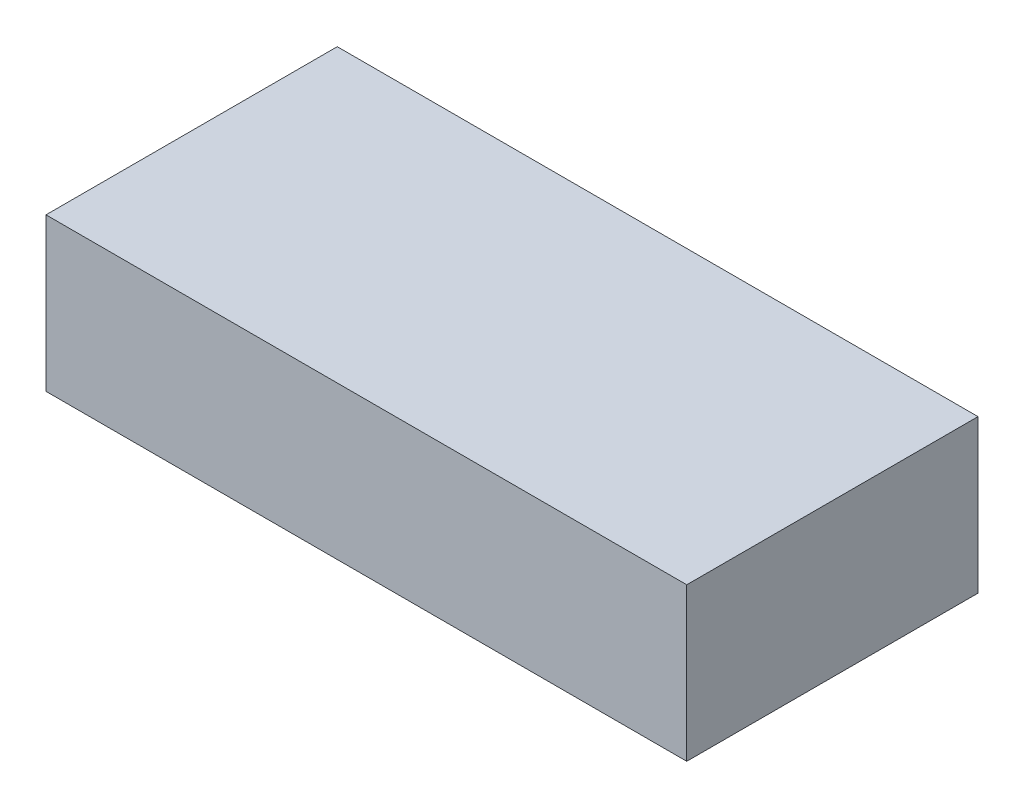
ISO-10303-21;
HEADER;
FILE_DESCRIPTION(('STEP AP214'),'2;1');
FILE_NAME('part.step','',(''),(''),'','','');
FILE_SCHEMA(('AUTOMOTIVE_DESIGN { 1 0 10303 214 1 1 1 1 }'));
ENDSEC;
DATA;
#1=APPLICATION_CONTEXT('core data for automotive mechanical design processes');
#2=APPLICATION_PROTOCOL_DEFINITION('international standard','automotive_design',2000,#1);
#3=PRODUCT_CONTEXT('',#1,'mechanical');
#4=PRODUCT('Part','Part','',(#3));
#5=PRODUCT_RELATED_PRODUCT_CATEGORY('part','',(#4));
#6=PRODUCT_DEFINITION_FORMATION('','',#4);
#7=PRODUCT_DEFINITION_CONTEXT('part definition',#1,'design');
#8=PRODUCT_DEFINITION('design','',#6,#7);
#9=PRODUCT_DEFINITION_SHAPE('','',#8);
#10=(LENGTH_UNIT() NAMED_UNIT(*) SI_UNIT(.MILLI.,.METRE.));
#11=(NAMED_UNIT(*) PLANE_ANGLE_UNIT() SI_UNIT($,.RADIAN.));
#12=(NAMED_UNIT(*) SI_UNIT($,.STERADIAN.) SOLID_ANGLE_UNIT());
#13=UNCERTAINTY_MEASURE_WITH_UNIT(LENGTH_MEASURE(1.E-05),#10,'distance_accuracy_value','');
#14=(GEOMETRIC_REPRESENTATION_CONTEXT(3) GLOBAL_UNCERTAINTY_ASSIGNED_CONTEXT((#13)) GLOBAL_UNIT_ASSIGNED_CONTEXT((#10,
#11,#12)) REPRESENTATION_CONTEXT('',''));
#15=CARTESIAN_POINT('',(0.,0.,0.));
#16=DIRECTION('',(0.,0.,1.));
#17=DIRECTION('',(1.,0.,0.));
#18=AXIS2_PLACEMENT_3D('',#15,#16,#17);
#19=CARTESIAN_POINT('',(88.,21.,0.));
#20=DIRECTION('',(0.,1.,0.));
#21=DIRECTION('',(0.,0.,1.));
#22=AXIS2_PLACEMENT_3D('',#19,#20,#21);
#23=PLANE('',#22);
#24=DIRECTION('',(0.,0.,-1.));
#25=VECTOR('',#24,1.);
#26=CARTESIAN_POINT('',(88.,21.,0.));
#27=LINE('',#26,#25);
#28=CARTESIAN_POINT('',(88.,21.,0.));
#29=VERTEX_POINT('',#28);
#30=CARTESIAN_POINT('',(88.,21.,80.));
#31=VERTEX_POINT('',#30);
#32=EDGE_CURVE('E20',#29,#31,#27,.F.);
#33=ORIENTED_EDGE('',*,*,#32,.F.);
#34=DIRECTION('',(1.,0.,0.));
#35=VECTOR('',#34,1.);
#36=CARTESIAN_POINT('',(0.,21.,0.));
#37=LINE('',#36,#35);
#38=CARTESIAN_POINT('',(-88.,21.,0.));
#39=VERTEX_POINT('',#38);
#40=EDGE_CURVE('E80',#29,#39,#37,.F.);
#41=ORIENTED_EDGE('',*,*,#40,.T.);
#42=DIRECTION('',(0.,0.,1.));
#43=VECTOR('',#42,1.);
#44=CARTESIAN_POINT('',(-88.,21.,0.));
#45=LINE('',#44,#43);
#46=CARTESIAN_POINT('',(-88.,21.,80.));
#47=VERTEX_POINT('',#46);
#48=EDGE_CURVE('E68',#47,#39,#45,.F.);
#49=ORIENTED_EDGE('',*,*,#48,.F.);
#50=DIRECTION('',(1.,0.,0.));
#51=VECTOR('',#50,1.);
#52=CARTESIAN_POINT('',(0.,21.,80.));
#53=LINE('',#52,#51);
#54=EDGE_CURVE('E56',#31,#47,#53,.F.);
#55=ORIENTED_EDGE('',*,*,#54,.F.);
#56=EDGE_LOOP('',(#33,#41,#49,#55));
#57=FACE_BOUND('',#56,.T.);
#58=ADVANCED_FACE('F17',(#57),#23,.T.);
#59=CARTESIAN_POINT('',(88.,-21.,0.));
#60=DIRECTION('',(1.,0.,0.));
#61=DIRECTION('',(0.,0.,-1.));
#62=AXIS2_PLACEMENT_3D('',#59,#60,#61);
#63=PLANE('',#62);
#64=DIRECTION('',(0.,0.,-1.));
#65=VECTOR('',#64,1.);
#66=CARTESIAN_POINT('',(88.,-21.,0.));
#67=LINE('',#66,#65);
#68=CARTESIAN_POINT('',(88.,-21.,0.));
#69=VERTEX_POINT('',#68);
#70=CARTESIAN_POINT('',(88.,-21.,80.));
#71=VERTEX_POINT('',#70);
#72=EDGE_CURVE('E83',#69,#71,#67,.F.);
#73=ORIENTED_EDGE('',*,*,#72,.F.);
#74=DIRECTION('',(0.,1.,0.));
#75=VECTOR('',#74,1.);
#76=CARTESIAN_POINT('',(88.,0.,0.));
#77=LINE('',#76,#75);
#78=EDGE_CURVE('E65',#69,#29,#77,.T.);
#79=ORIENTED_EDGE('',*,*,#78,.T.);
#80=ORIENTED_EDGE('',*,*,#32,.T.);
#81=DIRECTION('',(0.,1.,0.));
#82=VECTOR('',#81,1.);
#83=CARTESIAN_POINT('',(88.,0.,80.));
#84=LINE('',#83,#82);
#85=EDGE_CURVE('E62',#71,#31,#84,.T.);
#86=ORIENTED_EDGE('',*,*,#85,.F.);
#87=EDGE_LOOP('',(#73,#79,#80,#86));
#88=FACE_BOUND('',#87,.T.);
#89=ADVANCED_FACE('F61',(#88),#63,.T.);
#90=CARTESIAN_POINT('',(0.,0.,80.));
#91=DIRECTION('',(0.,0.,1.));
#92=DIRECTION('',(1.,0.,0.));
#93=AXIS2_PLACEMENT_3D('',#90,#91,#92);
#94=PLANE('',#93);
#95=DIRECTION('',(0.,1.,0.));
#96=VECTOR('',#95,1.);
#97=CARTESIAN_POINT('',(-88.,21.,80.));
#98=LINE('',#97,#96);
#99=CARTESIAN_POINT('',(-88.,-21.,80.));
#100=VERTEX_POINT('',#99);
#101=EDGE_CURVE('E70',#100,#47,#98,.T.);
#102=ORIENTED_EDGE('',*,*,#101,.F.);
#103=DIRECTION('',(1.,0.,0.));
#104=VECTOR('',#103,1.);
#105=CARTESIAN_POINT('',(-88.,-21.,80.));
#106=LINE('',#105,#104);
#107=EDGE_CURVE('E74',#71,#100,#106,.F.);
#108=ORIENTED_EDGE('',*,*,#107,.F.);
#109=ORIENTED_EDGE('',*,*,#85,.T.);
#110=ORIENTED_EDGE('',*,*,#54,.T.);
#111=EDGE_LOOP('',(#102,#108,#109,#110));
#112=FACE_BOUND('',#111,.T.);
#113=ADVANCED_FACE('F72',(#112),#94,.T.);
#114=CARTESIAN_POINT('',(-88.,21.,0.));
#115=DIRECTION('',(-1.,0.,0.));
#116=DIRECTION('',(0.,0.,1.));
#117=AXIS2_PLACEMENT_3D('',#114,#115,#116);
#118=PLANE('',#117);
#119=ORIENTED_EDGE('',*,*,#48,.T.);
#120=DIRECTION('',(0.,1.,0.));
#121=VECTOR('',#120,1.);
#122=CARTESIAN_POINT('',(-88.,0.,0.));
#123=LINE('',#122,#121);
#124=CARTESIAN_POINT('',(-88.,-21.,0.));
#125=VERTEX_POINT('',#124);
#126=EDGE_CURVE('E35',#39,#125,#123,.F.);
#127=ORIENTED_EDGE('',*,*,#126,.T.);
#128=DIRECTION('',(0.,0.,-1.));
#129=VECTOR('',#128,1.);
#130=CARTESIAN_POINT('',(-88.,-21.,0.));
#131=LINE('',#130,#129);
#132=EDGE_CURVE('E26',#100,#125,#131,.T.);
#133=ORIENTED_EDGE('',*,*,#132,.F.);
#134=ORIENTED_EDGE('',*,*,#101,.T.);
#135=EDGE_LOOP('',(#119,#127,#133,#134));
#136=FACE_BOUND('',#135,.T.);
#137=ADVANCED_FACE('F89',(#136),#118,.T.);
#138=CARTESIAN_POINT('',(0.,0.,0.));
#139=DIRECTION('',(0.,0.,1.));
#140=DIRECTION('',(1.,0.,0.));
#141=AXIS2_PLACEMENT_3D('',#138,#139,#140);
#142=PLANE('',#141);
#143=ORIENTED_EDGE('',*,*,#40,.F.);
#144=ORIENTED_EDGE('',*,*,#78,.F.);
#145=DIRECTION('',(1.,0.,0.));
#146=VECTOR('',#145,1.);
#147=CARTESIAN_POINT('',(-88.,-21.,0.));
#148=LINE('',#147,#146);
#149=EDGE_CURVE('E11',#125,#69,#148,.T.);
#150=ORIENTED_EDGE('',*,*,#149,.F.);
#151=ORIENTED_EDGE('',*,*,#126,.F.);
#152=EDGE_LOOP('',(#143,#144,#150,#151));
#153=FACE_BOUND('',#152,.T.);
#154=ADVANCED_FACE('F91',(#153),#142,.F.);
#155=CARTESIAN_POINT('',(-88.,-21.,0.));
#156=DIRECTION('',(0.,-1.,0.));
#157=DIRECTION('',(0.,0.,-1.));
#158=AXIS2_PLACEMENT_3D('',#155,#156,#157);
#159=PLANE('',#158);
#160=ORIENTED_EDGE('',*,*,#132,.T.);
#161=ORIENTED_EDGE('',*,*,#149,.T.);
#162=ORIENTED_EDGE('',*,*,#72,.T.);
#163=ORIENTED_EDGE('',*,*,#107,.T.);
#164=EDGE_LOOP('',(#160,#161,#162,#163));
#165=FACE_BOUND('',#164,.T.);
#166=ADVANCED_FACE('F88',(#165),#159,.T.);
#167=CLOSED_SHELL('',(#58,#89,#113,#137,#154,#166));
#168=MANIFOLD_SOLID_BREP('B1',#167);
#169=ADVANCED_BREP_SHAPE_REPRESENTATION('',(#18,#168),#14);
#170=SHAPE_DEFINITION_REPRESENTATION(#9,#169);
ENDSEC;
END-ISO-10303-21;
